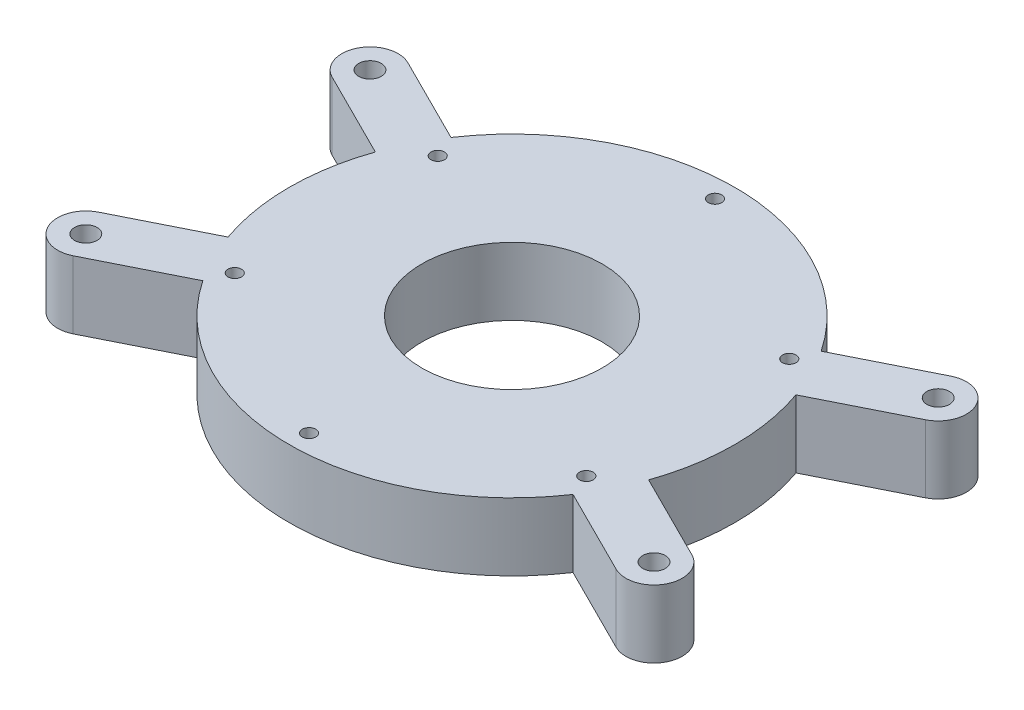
ISO-10303-21;
HEADER;
FILE_DESCRIPTION(('STEP AP214'),'2;1');
FILE_NAME('part.step','',(''),(''),'','','');
FILE_SCHEMA(('AUTOMOTIVE_DESIGN { 1 0 10303 214 1 1 1 1 }'));
ENDSEC;
DATA;
#1=APPLICATION_CONTEXT('core data for automotive mechanical design processes');
#2=APPLICATION_PROTOCOL_DEFINITION('international standard','automotive_design',2000,#1);
#3=PRODUCT_CONTEXT('',#1,'mechanical');
#4=PRODUCT('Part','Part','',(#3));
#5=PRODUCT_RELATED_PRODUCT_CATEGORY('part','',(#4));
#6=PRODUCT_DEFINITION_FORMATION('','',#4);
#7=PRODUCT_DEFINITION_CONTEXT('part definition',#1,'design');
#8=PRODUCT_DEFINITION('design','',#6,#7);
#9=PRODUCT_DEFINITION_SHAPE('','',#8);
#10=(LENGTH_UNIT() NAMED_UNIT(*) SI_UNIT(.MILLI.,.METRE.));
#11=(NAMED_UNIT(*) PLANE_ANGLE_UNIT() SI_UNIT($,.RADIAN.));
#12=(NAMED_UNIT(*) SI_UNIT($,.STERADIAN.) SOLID_ANGLE_UNIT());
#13=UNCERTAINTY_MEASURE_WITH_UNIT(LENGTH_MEASURE(1.E-05),#10,'distance_accuracy_value','');
#14=(GEOMETRIC_REPRESENTATION_CONTEXT(3) GLOBAL_UNCERTAINTY_ASSIGNED_CONTEXT((#13)) GLOBAL_UNIT_ASSIGNED_CONTEXT((#10,
#11,#12)) REPRESENTATION_CONTEXT('',''));
#15=CARTESIAN_POINT('',(0.,0.,0.));
#16=DIRECTION('',(0.,0.,1.));
#17=DIRECTION('',(1.,0.,0.));
#18=AXIS2_PLACEMENT_3D('',#15,#16,#17);
#19=CARTESIAN_POINT('',(0.,15.,0.));
#20=DIRECTION('',(0.,-1.,0.));
#21=DIRECTION('',(0.,0.,-1.));
#22=AXIS2_PLACEMENT_3D('',#19,#20,#21);
#23=CYLINDRICAL_SURFACE('',#22,49.4);
#24=CARTESIAN_POINT('',(0.,0.,0.));
#25=DIRECTION('',(0.,1.,0.));
#26=DIRECTION('',(0.,0.,1.));
#27=AXIS2_PLACEMENT_3D('',#24,#25,#26);
#28=CIRCLE('',#27,49.4);
#29=CARTESIAN_POINT('',(-41.0321866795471,0.,27.5085378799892));
#30=VERTEX_POINT('',#29);
#31=CARTESIAN_POINT('',(41.0321866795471,0.,27.5085378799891));
#32=VERTEX_POINT('',#31);
#33=EDGE_CURVE('E248',#30,#32,#28,.T.);
#34=ORIENTED_EDGE('',*,*,#33,.T.);
#35=DIRECTION('',(0.,-1.,0.));
#36=VECTOR('',#35,1.);
#37=CARTESIAN_POINT('',(41.0321866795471,15.,27.5085378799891));
#38=LINE('',#37,#36);
#39=CARTESIAN_POINT('',(41.0321866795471,15.,27.5085378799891));
#40=VERTEX_POINT('',#39);
#41=EDGE_CURVE('E12',#40,#32,#38,.T.);
#42=ORIENTED_EDGE('',*,*,#41,.F.);
#43=CARTESIAN_POINT('',(0.,15.,0.));
#44=DIRECTION('',(0.,1.,0.));
#45=DIRECTION('',(0.,0.,1.));
#46=AXIS2_PLACEMENT_3D('',#43,#44,#45);
#47=CIRCLE('',#46,49.4);
#48=CARTESIAN_POINT('',(-41.0321866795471,15.,27.5085378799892));
#49=VERTEX_POINT('',#48);
#50=EDGE_CURVE('E178',#49,#40,#47,.T.);
#51=ORIENTED_EDGE('',*,*,#50,.F.);
#52=DIRECTION('',(0.,-1.,0.));
#53=VECTOR('',#52,1.);
#54=CARTESIAN_POINT('',(-41.0321866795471,15.,27.5085378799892));
#55=LINE('',#54,#53);
#56=EDGE_CURVE('E244',#49,#30,#55,.T.);
#57=ORIENTED_EDGE('',*,*,#56,.T.);
#58=EDGE_LOOP('',(#34,#42,#51,#57));
#59=FACE_BOUND('',#58,.T.);
#60=ADVANCED_FACE('F96',(#59),#23,.T.);
#61=CARTESIAN_POINT('',(-2.79556780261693,15.,5.58992850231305));
#62=DIRECTION('',(-0.447290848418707,0.,0.894388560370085));
#63=DIRECTION('',(0.894388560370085,0.,0.447290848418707));
#64=AXIS2_PLACEMENT_3D('',#61,#62,#63);
#65=PLANE('',#64);
#66=DIRECTION('',(-0.894388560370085,0.,-0.447290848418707));
#67=VECTOR('',#66,1.);
#68=CARTESIAN_POINT('',(-2.79556780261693,0.,5.58992850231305));
#69=LINE('',#68,#67);
#70=CARTESIAN_POINT('',(60.1908307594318,0.,37.089928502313));
#71=VERTEX_POINT('',#70);
#72=EDGE_CURVE('E252',#71,#32,#69,.T.);
#73=ORIENTED_EDGE('',*,*,#72,.F.);
#74=DIRECTION('',(0.,-1.,0.));
#75=VECTOR('',#74,1.);
#76=CARTESIAN_POINT('',(60.1908307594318,15.,37.089928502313));
#77=LINE('',#76,#75);
#78=CARTESIAN_POINT('',(60.1908307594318,15.,37.089928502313));
#79=VERTEX_POINT('',#78);
#80=EDGE_CURVE('E106',#79,#71,#77,.T.);
#81=ORIENTED_EDGE('',*,*,#80,.F.);
#82=DIRECTION('',(-0.894388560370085,0.,-0.447290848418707));
#83=VECTOR('',#82,1.);
#84=CARTESIAN_POINT('',(-2.79556780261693,15.,5.58992850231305));
#85=LINE('',#84,#83);
#86=EDGE_CURVE('E330',#79,#40,#85,.T.);
#87=ORIENTED_EDGE('',*,*,#86,.T.);
#88=ORIENTED_EDGE('',*,*,#41,.T.);
#89=EDGE_LOOP('',(#73,#81,#87,#88));
#90=FACE_BOUND('',#89,.T.);
#91=ADVANCED_FACE('F411',(#90),#65,.T.);
#92=CARTESIAN_POINT('',(62.9863985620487,15.,31.5));
#93=DIRECTION('',(0.,-1.,0.));
#94=DIRECTION('',(0.,0.,-1.));
#95=AXIS2_PLACEMENT_3D('',#92,#93,#94);
#96=CYLINDRICAL_SURFACE('',#95,6.25);
#97=CARTESIAN_POINT('',(62.9863985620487,0.,31.5));
#98=DIRECTION('',(0.,1.,0.));
#99=DIRECTION('',(0.,0.,1.));
#100=AXIS2_PLACEMENT_3D('',#97,#98,#99);
#101=CIRCLE('',#100,6.25);
#102=CARTESIAN_POINT('',(65.7819663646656,0.,25.9100714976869));
#103=VERTEX_POINT('',#102);
#104=EDGE_CURVE('E257',#103,#71,#101,.F.);
#105=ORIENTED_EDGE('',*,*,#104,.F.);
#106=DIRECTION('',(0.,-1.,0.));
#107=VECTOR('',#106,1.);
#108=CARTESIAN_POINT('',(65.7819663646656,15.,25.9100714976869));
#109=LINE('',#108,#107);
#110=CARTESIAN_POINT('',(65.7819663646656,15.,25.9100714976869));
#111=VERTEX_POINT('',#110);
#112=EDGE_CURVE('E304',#111,#103,#109,.T.);
#113=ORIENTED_EDGE('',*,*,#112,.F.);
#114=CARTESIAN_POINT('',(62.9863985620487,15.,31.5));
#115=DIRECTION('',(0.,1.,0.));
#116=DIRECTION('',(0.,0.,1.));
#117=AXIS2_PLACEMENT_3D('',#114,#115,#116);
#118=CIRCLE('',#117,6.25);
#119=EDGE_CURVE('E334',#111,#79,#118,.F.);
#120=ORIENTED_EDGE('',*,*,#119,.T.);
#121=ORIENTED_EDGE('',*,*,#80,.T.);
#122=EDGE_LOOP('',(#105,#113,#120,#121));
#123=FACE_BOUND('',#122,.T.);
#124=ADVANCED_FACE('F416',(#123),#96,.T.);
#125=CARTESIAN_POINT('',(2.7955678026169,15.,-5.58992850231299));
#126=DIRECTION('',(-0.447290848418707,0.,0.894388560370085));
#127=DIRECTION('',(0.894388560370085,0.,0.447290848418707));
#128=AXIS2_PLACEMENT_3D('',#125,#126,#127);
#129=PLANE('',#128);
#130=DIRECTION('',(-0.894388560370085,0.,-0.447290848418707));
#131=VECTOR('',#130,1.);
#132=CARTESIAN_POINT('',(2.7955678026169,0.,-5.58992850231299));
#133=LINE('',#132,#131);
#134=CARTESIAN_POINT('',(46.623322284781,0.,16.3286808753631));
#135=VERTEX_POINT('',#134);
#136=EDGE_CURVE('E260',#103,#135,#133,.T.);
#137=ORIENTED_EDGE('',*,*,#136,.T.);
#138=DIRECTION('',(0.,-1.,0.));
#139=VECTOR('',#138,1.);
#140=CARTESIAN_POINT('',(46.623322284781,15.,16.3286808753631));
#141=LINE('',#140,#139);
#142=CARTESIAN_POINT('',(46.623322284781,15.,16.3286808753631));
#143=VERTEX_POINT('',#142);
#144=EDGE_CURVE('E301',#143,#135,#141,.T.);
#145=ORIENTED_EDGE('',*,*,#144,.F.);
#146=DIRECTION('',(-0.894388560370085,0.,-0.447290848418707));
#147=VECTOR('',#146,1.);
#148=CARTESIAN_POINT('',(2.7955678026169,15.,-5.58992850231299));
#149=LINE('',#148,#147);
#150=EDGE_CURVE('E337',#111,#143,#149,.T.);
#151=ORIENTED_EDGE('',*,*,#150,.F.);
#152=ORIENTED_EDGE('',*,*,#112,.T.);
#153=EDGE_LOOP('',(#137,#145,#151,#152));
#154=FACE_BOUND('',#153,.T.);
#155=ADVANCED_FACE('F422',(#154),#129,.F.);
#156=CARTESIAN_POINT('',(46.6233222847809,0.,-16.3286808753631));
#157=VERTEX_POINT('',#156);
#158=EDGE_CURVE('E254',#135,#157,#28,.T.);
#159=ORIENTED_EDGE('',*,*,#158,.T.);
#160=DIRECTION('',(0.,-1.,0.));
#161=VECTOR('',#160,1.);
#162=CARTESIAN_POINT('',(46.6233222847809,15.,-16.3286808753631));
#163=LINE('',#162,#161);
#164=CARTESIAN_POINT('',(46.6233222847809,15.,-16.3286808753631));
#165=VERTEX_POINT('',#164);
#166=EDGE_CURVE('E299',#165,#157,#163,.T.);
#167=ORIENTED_EDGE('',*,*,#166,.F.);
#168=EDGE_CURVE('E331',#143,#165,#47,.T.);
#169=ORIENTED_EDGE('',*,*,#168,.F.);
#170=ORIENTED_EDGE('',*,*,#144,.T.);
#171=EDGE_LOOP('',(#159,#167,#169,#170));
#172=FACE_BOUND('',#171,.T.);
#173=ADVANCED_FACE('F358',(#172),#23,.T.);
#174=CARTESIAN_POINT('',(2.7955678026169,15.,5.58992850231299));
#175=DIRECTION('',(0.447290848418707,0.,0.894388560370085));
#176=DIRECTION('',(0.894388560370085,0.,-0.447290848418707));
#177=AXIS2_PLACEMENT_3D('',#174,#175,#176);
#178=PLANE('',#177);
#179=DIRECTION('',(-0.894388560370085,0.,0.447290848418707));
#180=VECTOR('',#179,1.);
#181=CARTESIAN_POINT('',(2.7955678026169,0.,5.58992850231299));
#182=LINE('',#181,#180);
#183=CARTESIAN_POINT('',(65.7819663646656,0.,-25.910071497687));
#184=VERTEX_POINT('',#183);
#185=EDGE_CURVE('E262',#184,#157,#182,.T.);
#186=ORIENTED_EDGE('',*,*,#185,.F.);
#187=DIRECTION('',(0.,-1.,0.));
#188=VECTOR('',#187,1.);
#189=CARTESIAN_POINT('',(65.7819663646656,15.,-25.910071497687));
#190=LINE('',#189,#188);
#191=CARTESIAN_POINT('',(65.7819663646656,15.,-25.910071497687));
#192=VERTEX_POINT('',#191);
#193=EDGE_CURVE('E297',#192,#184,#190,.T.);
#194=ORIENTED_EDGE('',*,*,#193,.F.);
#195=DIRECTION('',(-0.894388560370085,0.,0.447290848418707));
#196=VECTOR('',#195,1.);
#197=CARTESIAN_POINT('',(2.7955678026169,15.,5.58992850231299));
#198=LINE('',#197,#196);
#199=EDGE_CURVE('E339',#192,#165,#198,.T.);
#200=ORIENTED_EDGE('',*,*,#199,.T.);
#201=ORIENTED_EDGE('',*,*,#166,.T.);
#202=EDGE_LOOP('',(#186,#194,#200,#201));
#203=FACE_BOUND('',#202,.T.);
#204=ADVANCED_FACE('F362',(#203),#178,.T.);
#205=CARTESIAN_POINT('',(62.9863985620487,15.,-31.5));
#206=DIRECTION('',(0.,-1.,0.));
#207=DIRECTION('',(0.,0.,-1.));
#208=AXIS2_PLACEMENT_3D('',#205,#206,#207);
#209=CYLINDRICAL_SURFACE('',#208,6.25);
#210=CARTESIAN_POINT('',(62.9863985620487,0.,-31.5));
#211=DIRECTION('',(0.,1.,0.));
#212=DIRECTION('',(0.,0.,1.));
#213=AXIS2_PLACEMENT_3D('',#210,#211,#212);
#214=CIRCLE('',#213,6.25);
#215=CARTESIAN_POINT('',(60.1908307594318,0.,-37.089928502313));
#216=VERTEX_POINT('',#215);
#217=EDGE_CURVE('E265',#184,#216,#214,.T.);
#218=ORIENTED_EDGE('',*,*,#217,.T.);
#219=DIRECTION('',(0.,-1.,0.));
#220=VECTOR('',#219,1.);
#221=CARTESIAN_POINT('',(60.1908307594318,15.,-37.089928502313));
#222=LINE('',#221,#220);
#223=CARTESIAN_POINT('',(60.1908307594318,15.,-37.089928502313));
#224=VERTEX_POINT('',#223);
#225=EDGE_CURVE('E294',#224,#216,#222,.T.);
#226=ORIENTED_EDGE('',*,*,#225,.F.);
#227=CARTESIAN_POINT('',(62.9863985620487,15.,-31.5));
#228=DIRECTION('',(0.,1.,0.));
#229=DIRECTION('',(0.,0.,1.));
#230=AXIS2_PLACEMENT_3D('',#227,#228,#229);
#231=CIRCLE('',#230,6.25);
#232=EDGE_CURVE('E342',#192,#224,#231,.T.);
#233=ORIENTED_EDGE('',*,*,#232,.F.);
#234=ORIENTED_EDGE('',*,*,#193,.T.);
#235=EDGE_LOOP('',(#218,#226,#233,#234));
#236=FACE_BOUND('',#235,.T.);
#237=ADVANCED_FACE('F367',(#236),#209,.T.);
#238=CARTESIAN_POINT('',(-2.79556780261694,15.,-5.58992850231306));
#239=DIRECTION('',(0.447290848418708,0.,0.894388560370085));
#240=DIRECTION('',(0.894388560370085,0.,-0.447290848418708));
#241=AXIS2_PLACEMENT_3D('',#238,#239,#240);
#242=PLANE('',#241);
#243=DIRECTION('',(-0.894388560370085,0.,0.447290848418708));
#244=VECTOR('',#243,1.);
#245=CARTESIAN_POINT('',(-2.79556780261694,0.,-5.58992850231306));
#246=LINE('',#245,#244);
#247=CARTESIAN_POINT('',(41.0321866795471,0.,-27.5085378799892));
#248=VERTEX_POINT('',#247);
#249=EDGE_CURVE('E267',#216,#248,#246,.T.);
#250=ORIENTED_EDGE('',*,*,#249,.T.);
#251=DIRECTION('',(0.,-1.,0.));
#252=VECTOR('',#251,1.);
#253=CARTESIAN_POINT('',(41.0321866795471,15.,-27.5085378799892));
#254=LINE('',#253,#252);
#255=CARTESIAN_POINT('',(41.0321866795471,15.,-27.5085378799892));
#256=VERTEX_POINT('',#255);
#257=EDGE_CURVE('E291',#256,#248,#254,.T.);
#258=ORIENTED_EDGE('',*,*,#257,.F.);
#259=DIRECTION('',(-0.894388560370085,0.,0.447290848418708));
#260=VECTOR('',#259,1.);
#261=CARTESIAN_POINT('',(-2.79556780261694,15.,-5.58992850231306));
#262=LINE('',#261,#260);
#263=EDGE_CURVE('E344',#224,#256,#262,.T.);
#264=ORIENTED_EDGE('',*,*,#263,.F.);
#265=ORIENTED_EDGE('',*,*,#225,.T.);
#266=EDGE_LOOP('',(#250,#258,#264,#265));
#267=FACE_BOUND('',#266,.T.);
#268=ADVANCED_FACE('F371',(#267),#242,.F.);
#269=CARTESIAN_POINT('',(-41.0321866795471,0.,-27.5085378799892));
#270=VERTEX_POINT('',#269);
#271=EDGE_CURVE('E269',#248,#270,#28,.T.);
#272=ORIENTED_EDGE('',*,*,#271,.T.);
#273=DIRECTION('',(0.,-1.,0.));
#274=VECTOR('',#273,1.);
#275=CARTESIAN_POINT('',(-41.0321866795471,15.,-27.5085378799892));
#276=LINE('',#275,#274);
#277=CARTESIAN_POINT('',(-41.0321866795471,15.,-27.5085378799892));
#278=VERTEX_POINT('',#277);
#279=EDGE_CURVE('E289',#278,#270,#276,.T.);
#280=ORIENTED_EDGE('',*,*,#279,.F.);
#281=EDGE_CURVE('E239',#256,#278,#47,.T.);
#282=ORIENTED_EDGE('',*,*,#281,.F.);
#283=ORIENTED_EDGE('',*,*,#257,.T.);
#284=EDGE_LOOP('',(#272,#280,#282,#283));
#285=FACE_BOUND('',#284,.T.);
#286=ADVANCED_FACE('F376',(#285),#23,.T.);
#287=CARTESIAN_POINT('',(2.79556780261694,15.,-5.58992850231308));
#288=DIRECTION('',(0.447290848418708,0.,-0.894388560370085));
#289=DIRECTION('',(-0.894388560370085,0.,-0.447290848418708));
#290=AXIS2_PLACEMENT_3D('',#287,#288,#289);
#291=PLANE('',#290);
#292=DIRECTION('',(0.894388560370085,0.,0.447290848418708));
#293=VECTOR('',#292,1.);
#294=CARTESIAN_POINT('',(2.79556780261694,0.,-5.58992850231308));
#295=LINE('',#294,#293);
#296=CARTESIAN_POINT('',(-60.1908307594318,0.,-37.089928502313));
#297=VERTEX_POINT('',#296);
#298=EDGE_CURVE('E270',#297,#270,#295,.T.);
#299=ORIENTED_EDGE('',*,*,#298,.F.);
#300=DIRECTION('',(0.,-1.,0.));
#301=VECTOR('',#300,1.);
#302=CARTESIAN_POINT('',(-60.1908307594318,15.,-37.089928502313));
#303=LINE('',#302,#301);
#304=CARTESIAN_POINT('',(-60.1908307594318,15.,-37.089928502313));
#305=VERTEX_POINT('',#304);
#306=EDGE_CURVE('E287',#305,#297,#303,.T.);
#307=ORIENTED_EDGE('',*,*,#306,.F.);
#308=DIRECTION('',(0.894388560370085,0.,0.447290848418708));
#309=VECTOR('',#308,1.);
#310=CARTESIAN_POINT('',(2.79556780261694,15.,-5.58992850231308));
#311=LINE('',#310,#309);
#312=EDGE_CURVE('E345',#305,#278,#311,.T.);
#313=ORIENTED_EDGE('',*,*,#312,.T.);
#314=ORIENTED_EDGE('',*,*,#279,.T.);
#315=EDGE_LOOP('',(#299,#307,#313,#314));
#316=FACE_BOUND('',#315,.T.);
#317=ADVANCED_FACE('F377',(#316),#291,.T.);
#318=CARTESIAN_POINT('',(-2.79556780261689,15.,5.58992850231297));
#319=DIRECTION('',(0.447290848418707,0.,-0.894388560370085));
#320=DIRECTION('',(-0.894388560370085,0.,-0.447290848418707));
#321=AXIS2_PLACEMENT_3D('',#318,#319,#320);
#322=PLANE('',#321);
#323=DIRECTION('',(0.894388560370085,0.,0.447290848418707));
#324=VECTOR('',#323,1.);
#325=CARTESIAN_POINT('',(-2.79556780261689,0.,5.58992850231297));
#326=LINE('',#325,#324);
#327=CARTESIAN_POINT('',(-65.7819663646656,0.,-25.910071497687));
#328=VERTEX_POINT('',#327);
#329=CARTESIAN_POINT('',(-46.6233222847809,0.,-16.3286808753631));
#330=VERTEX_POINT('',#329);
#331=EDGE_CURVE('E273',#328,#330,#326,.T.);
#332=ORIENTED_EDGE('',*,*,#331,.T.);
#333=DIRECTION('',(0.,-1.,0.));
#334=VECTOR('',#333,1.);
#335=CARTESIAN_POINT('',(-46.6233222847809,15.,-16.3286808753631));
#336=LINE('',#335,#334);
#337=CARTESIAN_POINT('',(-46.6233222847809,15.,-16.3286808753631));
#338=VERTEX_POINT('',#337);
#339=EDGE_CURVE('E282',#338,#330,#336,.T.);
#340=ORIENTED_EDGE('',*,*,#339,.F.);
#341=DIRECTION('',(0.894388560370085,0.,0.447290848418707));
#342=VECTOR('',#341,1.);
#343=CARTESIAN_POINT('',(-2.79556780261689,15.,5.58992850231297));
#344=LINE('',#343,#342);
#345=CARTESIAN_POINT('',(-65.7819663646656,15.,-25.910071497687));
#346=VERTEX_POINT('',#345);
#347=EDGE_CURVE('E237',#346,#338,#344,.T.);
#348=ORIENTED_EDGE('',*,*,#347,.F.);
#349=DIRECTION('',(0.,-1.,0.));
#350=VECTOR('',#349,1.);
#351=CARTESIAN_POINT('',(-65.7819663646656,15.,-25.910071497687));
#352=LINE('',#351,#350);
#353=EDGE_CURVE('E285',#346,#328,#352,.T.);
#354=ORIENTED_EDGE('',*,*,#353,.T.);
#355=EDGE_LOOP('',(#332,#340,#348,#354));
#356=FACE_BOUND('',#355,.T.);
#357=ADVANCED_FACE('F424',(#356),#322,.F.);
#358=CARTESIAN_POINT('',(-46.6233222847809,0.,16.3286808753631));
#359=VERTEX_POINT('',#358);
#360=EDGE_CURVE('E253',#330,#359,#28,.T.);
#361=ORIENTED_EDGE('',*,*,#360,.T.);
#362=DIRECTION('',(0.,-1.,0.));
#363=VECTOR('',#362,1.);
#364=CARTESIAN_POINT('',(-46.6233222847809,15.,16.3286808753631));
#365=LINE('',#364,#363);
#366=CARTESIAN_POINT('',(-46.6233222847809,15.,16.3286808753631));
#367=VERTEX_POINT('',#366);
#368=EDGE_CURVE('E226',#367,#359,#365,.T.);
#369=ORIENTED_EDGE('',*,*,#368,.F.);
#370=EDGE_CURVE('E234',#338,#367,#47,.T.);
#371=ORIENTED_EDGE('',*,*,#370,.F.);
#372=ORIENTED_EDGE('',*,*,#339,.T.);
#373=EDGE_LOOP('',(#361,#369,#371,#372));
#374=FACE_BOUND('',#373,.T.);
#375=ADVANCED_FACE('F383',(#374),#23,.T.);
#376=CARTESIAN_POINT('',(-2.79556780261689,15.,-5.58992850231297));
#377=DIRECTION('',(-0.447290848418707,0.,-0.894388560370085));
#378=DIRECTION('',(-0.894388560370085,0.,0.447290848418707));
#379=AXIS2_PLACEMENT_3D('',#376,#377,#378);
#380=PLANE('',#379);
#381=DIRECTION('',(0.894388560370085,0.,-0.447290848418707));
#382=VECTOR('',#381,1.);
#383=CARTESIAN_POINT('',(-2.79556780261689,0.,-5.58992850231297));
#384=LINE('',#383,#382);
#385=CARTESIAN_POINT('',(-65.7819663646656,0.,25.910071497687));
#386=VERTEX_POINT('',#385);
#387=EDGE_CURVE('E225',#386,#359,#384,.T.);
#388=ORIENTED_EDGE('',*,*,#387,.F.);
#389=DIRECTION('',(0.,-1.,0.));
#390=VECTOR('',#389,1.);
#391=CARTESIAN_POINT('',(-65.7819663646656,15.,25.910071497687));
#392=LINE('',#391,#390);
#393=CARTESIAN_POINT('',(-65.7819663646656,15.,25.910071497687));
#394=VERTEX_POINT('',#393);
#395=EDGE_CURVE('E219',#394,#386,#392,.T.);
#396=ORIENTED_EDGE('',*,*,#395,.F.);
#397=DIRECTION('',(0.894388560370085,0.,-0.447290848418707));
#398=VECTOR('',#397,1.);
#399=CARTESIAN_POINT('',(-2.79556780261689,15.,-5.58992850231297));
#400=LINE('',#399,#398);
#401=EDGE_CURVE('E223',#394,#367,#400,.T.);
#402=ORIENTED_EDGE('',*,*,#401,.T.);
#403=ORIENTED_EDGE('',*,*,#368,.T.);
#404=EDGE_LOOP('',(#388,#396,#402,#403));
#405=FACE_BOUND('',#404,.T.);
#406=ADVANCED_FACE('F221',(#405),#380,.T.);
#407=CARTESIAN_POINT('',(-62.9863985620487,15.,31.5));
#408=DIRECTION('',(0.,-1.,0.));
#409=DIRECTION('',(0.,0.,-1.));
#410=AXIS2_PLACEMENT_3D('',#407,#408,#409);
#411=CYLINDRICAL_SURFACE('',#410,6.25000000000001);
#412=CARTESIAN_POINT('',(-62.9863985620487,0.,31.5));
#413=DIRECTION('',(0.,1.,0.));
#414=DIRECTION('',(0.,0.,1.));
#415=AXIS2_PLACEMENT_3D('',#412,#413,#414);
#416=CIRCLE('',#415,6.25000000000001);
#417=CARTESIAN_POINT('',(-60.1908307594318,0.,37.089928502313));
#418=VERTEX_POINT('',#417);
#419=EDGE_CURVE('E166',#386,#418,#416,.T.);
#420=ORIENTED_EDGE('',*,*,#419,.T.);
#421=DIRECTION('',(0.,-1.,0.));
#422=VECTOR('',#421,1.);
#423=CARTESIAN_POINT('',(-60.1908307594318,15.,37.089928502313));
#424=LINE('',#423,#422);
#425=CARTESIAN_POINT('',(-60.1908307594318,15.,37.089928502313));
#426=VERTEX_POINT('',#425);
#427=EDGE_CURVE('E227',#426,#418,#424,.T.);
#428=ORIENTED_EDGE('',*,*,#427,.F.);
#429=CARTESIAN_POINT('',(-62.9863985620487,15.,31.5));
#430=DIRECTION('',(0.,1.,0.));
#431=DIRECTION('',(0.,0.,1.));
#432=AXIS2_PLACEMENT_3D('',#429,#430,#431);
#433=CIRCLE('',#432,6.25000000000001);
#434=EDGE_CURVE('E229',#394,#426,#433,.T.);
#435=ORIENTED_EDGE('',*,*,#434,.F.);
#436=ORIENTED_EDGE('',*,*,#395,.T.);
#437=EDGE_LOOP('',(#420,#428,#435,#436));
#438=FACE_BOUND('',#437,.T.);
#439=ADVANCED_FACE('F230',(#438),#411,.T.);
#440=CARTESIAN_POINT('',(0.,15.,0.));
#441=DIRECTION('',(0.,-1.,0.));
#442=DIRECTION('',(0.,0.,-1.));
#443=AXIS2_PLACEMENT_3D('',#440,#441,#442);
#444=CYLINDRICAL_SURFACE('',#443,20.);
#445=CARTESIAN_POINT('',(0.,15.,0.));
#446=DIRECTION('',(0.,1.,0.));
#447=DIRECTION('',(0.,0.,1.));
#448=AXIS2_PLACEMENT_3D('',#445,#446,#447);
#449=CIRCLE('',#448,20.);
#450=CARTESIAN_POINT('',(0.,15.,20.));
#451=VERTEX_POINT('',#450);
#452=EDGE_CURVE('E278',#451,#451,#449,.T.);
#453=ORIENTED_EDGE('',*,*,#452,.T.);
#454=EDGE_LOOP('',(#453));
#455=FACE_BOUND('',#454,.T.);
#456=CARTESIAN_POINT('',(0.,0.,0.));
#457=DIRECTION('',(0.,1.,0.));
#458=DIRECTION('',(0.,0.,1.));
#459=AXIS2_PLACEMENT_3D('',#456,#457,#458);
#460=CIRCLE('',#459,20.);
#461=CARTESIAN_POINT('',(0.,0.,20.));
#462=VERTEX_POINT('',#461);
#463=EDGE_CURVE('E245',#462,#462,#460,.T.);
#464=ORIENTED_EDGE('',*,*,#463,.F.);
#465=EDGE_LOOP('',(#464));
#466=FACE_BOUND('',#465,.T.);
#467=ADVANCED_FACE('F389',(#455,#466),#444,.F.);
#468=CARTESIAN_POINT('',(2.79556780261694,15.,5.58992850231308));
#469=DIRECTION('',(-0.447290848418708,0.,-0.894388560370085));
#470=DIRECTION('',(-0.894388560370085,0.,0.447290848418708));
#471=AXIS2_PLACEMENT_3D('',#468,#469,#470);
#472=PLANE('',#471);
#473=DIRECTION('',(0.894388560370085,0.,-0.447290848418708));
#474=VECTOR('',#473,1.);
#475=CARTESIAN_POINT('',(2.79556780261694,0.,5.58992850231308));
#476=LINE('',#475,#474);
#477=EDGE_CURVE('E172',#418,#30,#476,.T.);
#478=ORIENTED_EDGE('',*,*,#477,.T.);
#479=ORIENTED_EDGE('',*,*,#56,.F.);
#480=DIRECTION('',(0.894388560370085,0.,-0.447290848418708));
#481=VECTOR('',#480,1.);
#482=CARTESIAN_POINT('',(2.79556780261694,15.,5.58992850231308));
#483=LINE('',#482,#481);
#484=EDGE_CURVE('E115',#426,#49,#483,.T.);
#485=ORIENTED_EDGE('',*,*,#484,.F.);
#486=ORIENTED_EDGE('',*,*,#427,.T.);
#487=EDGE_LOOP('',(#478,#479,#485,#486));
#488=FACE_BOUND('',#487,.T.);
#489=ADVANCED_FACE('F387',(#488),#472,.F.);
#490=CARTESIAN_POINT('',(0.,15.,0.));
#491=DIRECTION('',(0.,1.,0.));
#492=DIRECTION('',(0.,0.,1.));
#493=AXIS2_PLACEMENT_3D('',#490,#491,#492);
#494=PLANE('',#493);
#495=CARTESIAN_POINT('',(38.9711431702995,15.,-22.5000000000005));
#496=DIRECTION('',(0.,-1.,0.));
#497=DIRECTION('',(0.866025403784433,0.,-0.50000000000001));
#498=AXIS2_PLACEMENT_3D('',#495,#496,#497);
#499=CIRCLE('',#498,1.5);
#500=CARTESIAN_POINT('',(40.2701812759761,15.,-23.2500000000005));
#501=VERTEX_POINT('',#500);
#502=EDGE_CURVE('E907',#501,#501,#499,.T.);
#503=ORIENTED_EDGE('',*,*,#502,.T.);
#504=EDGE_LOOP('',(#503));
#505=FACE_BOUND('',#504,.T.);
#506=CARTESIAN_POINT('',(38.9711431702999,15.,22.4999999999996));
#507=DIRECTION('',(0.,-1.,0.));
#508=DIRECTION('',(0.866025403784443,0.,0.499999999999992));
#509=AXIS2_PLACEMENT_3D('',#506,#507,#508);
#510=CIRCLE('',#509,1.5);
#511=CARTESIAN_POINT('',(40.2701812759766,15.,23.2499999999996));
#512=VERTEX_POINT('',#511);
#513=EDGE_CURVE('E1023',#512,#512,#510,.T.);
#514=ORIENTED_EDGE('',*,*,#513,.T.);
#515=EDGE_LOOP('',(#514));
#516=FACE_BOUND('',#515,.T.);
#517=CARTESIAN_POINT('',(0.,15.,45.));
#518=DIRECTION('',(0.,-1.,0.));
#519=DIRECTION('',(0.,0.,1.));
#520=AXIS2_PLACEMENT_3D('',#517,#518,#519);
#521=CIRCLE('',#520,1.5);
#522=CARTESIAN_POINT('',(0.,15.,46.5));
#523=VERTEX_POINT('',#522);
#524=EDGE_CURVE('E1015',#523,#523,#521,.T.);
#525=ORIENTED_EDGE('',*,*,#524,.T.);
#526=EDGE_LOOP('',(#525));
#527=FACE_BOUND('',#526,.T.);
#528=CARTESIAN_POINT('',(-38.9711431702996,15.,22.5000000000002));
#529=DIRECTION('',(0.,-1.,0.));
#530=DIRECTION('',(-0.866025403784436,0.,0.500000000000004));
#531=AXIS2_PLACEMENT_3D('',#528,#529,#530);
#532=CIRCLE('',#531,1.5);
#533=CARTESIAN_POINT('',(-40.2701812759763,15.,23.2500000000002));
#534=VERTEX_POINT('',#533);
#535=EDGE_CURVE('E923',#534,#534,#532,.T.);
#536=ORIENTED_EDGE('',*,*,#535,.T.);
#537=EDGE_LOOP('',(#536));
#538=FACE_BOUND('',#537,.T.);
#539=CARTESIAN_POINT('',(-38.9711431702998,15.,-22.4999999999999));
#540=DIRECTION('',(0.,-1.,0.));
#541=DIRECTION('',(-0.86602540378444,0.,-0.499999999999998));
#542=AXIS2_PLACEMENT_3D('',#539,#540,#541);
#543=CIRCLE('',#542,1.5);
#544=CARTESIAN_POINT('',(-40.2701812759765,15.,-23.2499999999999));
#545=VERTEX_POINT('',#544);
#546=EDGE_CURVE('E916',#545,#545,#543,.T.);
#547=ORIENTED_EDGE('',*,*,#546,.T.);
#548=EDGE_LOOP('',(#547));
#549=FACE_BOUND('',#548,.T.);
#550=CARTESIAN_POINT('',(0.,15.,-45.));
#551=DIRECTION('',(0.,-1.,0.));
#552=DIRECTION('',(0.,0.,-1.));
#553=AXIS2_PLACEMENT_3D('',#550,#551,#552);
#554=CIRCLE('',#553,1.5);
#555=CARTESIAN_POINT('',(0.,15.,-46.5));
#556=VERTEX_POINT('',#555);
#557=EDGE_CURVE('E924',#556,#556,#554,.T.);
#558=ORIENTED_EDGE('',*,*,#557,.T.);
#559=EDGE_LOOP('',(#558));
#560=FACE_BOUND('',#559,.T.);
#561=CARTESIAN_POINT('',(62.9863985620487,15.,-31.5));
#562=DIRECTION('',(0.,-1.,0.));
#563=DIRECTION('',(0.,0.,1.));
#564=AXIS2_PLACEMENT_3D('',#561,#562,#563);
#565=CIRCLE('',#564,2.50000000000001);
#566=CARTESIAN_POINT('',(62.9863985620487,15.,-29.));
#567=VERTEX_POINT('',#566);
#568=EDGE_CURVE('E951',#567,#567,#565,.T.);
#569=ORIENTED_EDGE('',*,*,#568,.T.);
#570=EDGE_LOOP('',(#569));
#571=FACE_BOUND('',#570,.T.);
#572=CARTESIAN_POINT('',(62.9863985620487,15.,31.5));
#573=DIRECTION('',(0.,1.,0.));
#574=DIRECTION('',(0.,0.,-1.));
#575=AXIS2_PLACEMENT_3D('',#572,#573,#574);
#576=CIRCLE('',#575,2.50000000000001);
#577=CARTESIAN_POINT('',(62.9863985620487,15.,29.));
#578=VERTEX_POINT('',#577);
#579=EDGE_CURVE('E957',#578,#578,#576,.T.);
#580=ORIENTED_EDGE('',*,*,#579,.F.);
#581=EDGE_LOOP('',(#580));
#582=FACE_BOUND('',#581,.T.);
#583=CARTESIAN_POINT('',(-62.9863985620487,15.,31.5));
#584=DIRECTION('',(0.,-1.,0.));
#585=DIRECTION('',(0.,0.,-1.));
#586=AXIS2_PLACEMENT_3D('',#583,#584,#585);
#587=CIRCLE('',#586,2.50000000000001);
#588=CARTESIAN_POINT('',(-62.9863985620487,15.,29.));
#589=VERTEX_POINT('',#588);
#590=EDGE_CURVE('E325',#589,#589,#587,.T.);
#591=ORIENTED_EDGE('',*,*,#590,.T.);
#592=EDGE_LOOP('',(#591));
#593=FACE_BOUND('',#592,.T.);
#594=CARTESIAN_POINT('',(-62.9863985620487,15.,-31.5));
#595=DIRECTION('',(0.,1.,0.));
#596=DIRECTION('',(0.,0.,1.));
#597=AXIS2_PLACEMENT_3D('',#594,#595,#596);
#598=CIRCLE('',#597,2.50000000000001);
#599=CARTESIAN_POINT('',(-62.9863985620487,15.,-29.));
#600=VERTEX_POINT('',#599);
#601=EDGE_CURVE('E317',#600,#600,#598,.T.);
#602=ORIENTED_EDGE('',*,*,#601,.F.);
#603=EDGE_LOOP('',(#602));
#604=FACE_BOUND('',#603,.T.);
#605=ORIENTED_EDGE('',*,*,#452,.F.);
#606=EDGE_LOOP('',(#605));
#607=FACE_BOUND('',#606,.T.);
#608=ORIENTED_EDGE('',*,*,#50,.T.);
#609=ORIENTED_EDGE('',*,*,#86,.F.);
#610=ORIENTED_EDGE('',*,*,#119,.F.);
#611=ORIENTED_EDGE('',*,*,#150,.T.);
#612=ORIENTED_EDGE('',*,*,#168,.T.);
#613=ORIENTED_EDGE('',*,*,#199,.F.);
#614=ORIENTED_EDGE('',*,*,#232,.T.);
#615=ORIENTED_EDGE('',*,*,#263,.T.);
#616=ORIENTED_EDGE('',*,*,#281,.T.);
#617=ORIENTED_EDGE('',*,*,#312,.F.);
#618=CARTESIAN_POINT('',(-62.9863985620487,15.,-31.5));
#619=DIRECTION('',(0.,-1.,0.));
#620=DIRECTION('',(0.,0.,-1.));
#621=AXIS2_PLACEMENT_3D('',#618,#619,#620);
#622=CIRCLE('',#621,6.25000000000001);
#623=EDGE_CURVE('E249',#346,#305,#622,.T.);
#624=ORIENTED_EDGE('',*,*,#623,.F.);
#625=ORIENTED_EDGE('',*,*,#347,.T.);
#626=ORIENTED_EDGE('',*,*,#370,.T.);
#627=ORIENTED_EDGE('',*,*,#401,.F.);
#628=ORIENTED_EDGE('',*,*,#434,.T.);
#629=ORIENTED_EDGE('',*,*,#484,.T.);
#630=EDGE_LOOP('',(#608,#609,#610,#611,#612,#613,#614,#615,#616,#617,#624,#625,#626,#627,#628,#629));
#631=FACE_BOUND('',#630,.T.);
#632=ADVANCED_FACE('F232',(#505,#516,#527,#538,#549,#560,#571,#582,#593,#604,#607,#631),#494,.T.);
#633=CARTESIAN_POINT('',(0.,0.,0.));
#634=DIRECTION('',(0.,1.,0.));
#635=DIRECTION('',(0.,0.,1.));
#636=AXIS2_PLACEMENT_3D('',#633,#634,#635);
#637=PLANE('',#636);
#638=CARTESIAN_POINT('',(38.9711431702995,0.,-22.5000000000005));
#639=DIRECTION('',(0.,-1.,0.));
#640=DIRECTION('',(0.866025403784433,0.,-0.50000000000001));
#641=AXIS2_PLACEMENT_3D('',#638,#639,#640);
#642=CIRCLE('',#641,1.5);
#643=CARTESIAN_POINT('',(40.2701812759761,0.,-23.2500000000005));
#644=VERTEX_POINT('',#643);
#645=EDGE_CURVE('E910',#644,#644,#642,.T.);
#646=ORIENTED_EDGE('',*,*,#645,.F.);
#647=EDGE_LOOP('',(#646));
#648=FACE_BOUND('',#647,.T.);
#649=CARTESIAN_POINT('',(38.9711431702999,0.,22.4999999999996));
#650=DIRECTION('',(0.,-1.,0.));
#651=DIRECTION('',(0.866025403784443,0.,0.499999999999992));
#652=AXIS2_PLACEMENT_3D('',#649,#650,#651);
#653=CIRCLE('',#652,1.5);
#654=CARTESIAN_POINT('',(40.2701812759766,0.,23.2499999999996));
#655=VERTEX_POINT('',#654);
#656=EDGE_CURVE('E912',#655,#655,#653,.T.);
#657=ORIENTED_EDGE('',*,*,#656,.F.);
#658=EDGE_LOOP('',(#657));
#659=FACE_BOUND('',#658,.T.);
#660=CARTESIAN_POINT('',(0.,0.,45.));
#661=DIRECTION('',(0.,-1.,0.));
#662=DIRECTION('',(0.,0.,1.));
#663=AXIS2_PLACEMENT_3D('',#660,#661,#662);
#664=CIRCLE('',#663,1.5);
#665=CARTESIAN_POINT('',(0.,0.,46.5));
#666=VERTEX_POINT('',#665);
#667=EDGE_CURVE('E1020',#666,#666,#664,.T.);
#668=ORIENTED_EDGE('',*,*,#667,.F.);
#669=EDGE_LOOP('',(#668));
#670=FACE_BOUND('',#669,.T.);
#671=CARTESIAN_POINT('',(-38.9711431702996,0.,22.5000000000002));
#672=DIRECTION('',(0.,-1.,0.));
#673=DIRECTION('',(-0.866025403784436,0.,0.500000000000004));
#674=AXIS2_PLACEMENT_3D('',#671,#672,#673);
#675=CIRCLE('',#674,1.5);
#676=CARTESIAN_POINT('',(-40.2701812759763,0.,23.2500000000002));
#677=VERTEX_POINT('',#676);
#678=EDGE_CURVE('E1010',#677,#677,#675,.T.);
#679=ORIENTED_EDGE('',*,*,#678,.F.);
#680=EDGE_LOOP('',(#679));
#681=FACE_BOUND('',#680,.T.);
#682=CARTESIAN_POINT('',(-38.9711431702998,0.,-22.4999999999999));
#683=DIRECTION('',(0.,-1.,0.));
#684=DIRECTION('',(-0.86602540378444,0.,-0.499999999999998));
#685=AXIS2_PLACEMENT_3D('',#682,#683,#684);
#686=CIRCLE('',#685,1.5);
#687=CARTESIAN_POINT('',(-40.2701812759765,0.,-23.2499999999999));
#688=VERTEX_POINT('',#687);
#689=EDGE_CURVE('E920',#688,#688,#686,.T.);
#690=ORIENTED_EDGE('',*,*,#689,.F.);
#691=EDGE_LOOP('',(#690));
#692=FACE_BOUND('',#691,.T.);
#693=CARTESIAN_POINT('',(0.,0.,-45.));
#694=DIRECTION('',(0.,-1.,0.));
#695=DIRECTION('',(0.,0.,-1.));
#696=AXIS2_PLACEMENT_3D('',#693,#694,#695);
#697=CIRCLE('',#696,1.5);
#698=CARTESIAN_POINT('',(0.,0.,-46.5));
#699=VERTEX_POINT('',#698);
#700=EDGE_CURVE('E919',#699,#699,#697,.T.);
#701=ORIENTED_EDGE('',*,*,#700,.F.);
#702=EDGE_LOOP('',(#701));
#703=FACE_BOUND('',#702,.T.);
#704=CARTESIAN_POINT('',(-54.0425129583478,0.,-27.0270915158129));
#705=DIRECTION('',(0.,1.,0.));
#706=DIRECTION('',(0.,0.,1.));
#707=AXIS2_PLACEMENT_3D('',#704,#705,#706);
#708=CIRCLE('',#707,2.5);
#709=CARTESIAN_POINT('',(-54.0425129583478,0.,-24.5270915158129));
#710=VERTEX_POINT('',#709);
#711=EDGE_CURVE('E927',#710,#710,#708,.T.);
#712=ORIENTED_EDGE('',*,*,#711,.T.);
#713=EDGE_LOOP('',(#712));
#714=FACE_BOUND('',#713,.T.);
#715=CARTESIAN_POINT('',(54.0425129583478,0.,-27.0270915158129));
#716=DIRECTION('',(0.,-1.,0.));
#717=DIRECTION('',(0.,0.,1.));
#718=AXIS2_PLACEMENT_3D('',#715,#716,#717);
#719=CIRCLE('',#718,2.5);
#720=CARTESIAN_POINT('',(54.0425129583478,0.,-24.5270915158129));
#721=VERTEX_POINT('',#720);
#722=EDGE_CURVE('E933',#721,#721,#719,.T.);
#723=ORIENTED_EDGE('',*,*,#722,.F.);
#724=EDGE_LOOP('',(#723));
#725=FACE_BOUND('',#724,.T.);
#726=CARTESIAN_POINT('',(54.0425129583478,0.,27.0270915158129));
#727=DIRECTION('',(0.,1.,0.));
#728=DIRECTION('',(0.,0.,-1.));
#729=AXIS2_PLACEMENT_3D('',#726,#727,#728);
#730=CIRCLE('',#729,2.5);
#731=CARTESIAN_POINT('',(54.0425129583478,0.,24.5270915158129));
#732=VERTEX_POINT('',#731);
#733=EDGE_CURVE('E939',#732,#732,#730,.T.);
#734=ORIENTED_EDGE('',*,*,#733,.T.);
#735=EDGE_LOOP('',(#734));
#736=FACE_BOUND('',#735,.T.);
#737=CARTESIAN_POINT('',(-54.0425129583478,0.,27.0270915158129));
#738=DIRECTION('',(0.,-1.,0.));
#739=DIRECTION('',(0.,0.,-1.));
#740=AXIS2_PLACEMENT_3D('',#737,#738,#739);
#741=CIRCLE('',#740,2.5);
#742=CARTESIAN_POINT('',(-54.0425129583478,0.,24.5270915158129));
#743=VERTEX_POINT('',#742);
#744=EDGE_CURVE('E945',#743,#743,#741,.T.);
#745=ORIENTED_EDGE('',*,*,#744,.F.);
#746=EDGE_LOOP('',(#745));
#747=FACE_BOUND('',#746,.T.);
#748=ORIENTED_EDGE('',*,*,#463,.T.);
#749=EDGE_LOOP('',(#748));
#750=FACE_BOUND('',#749,.T.);
#751=ORIENTED_EDGE('',*,*,#33,.F.);
#752=ORIENTED_EDGE('',*,*,#477,.F.);
#753=ORIENTED_EDGE('',*,*,#419,.F.);
#754=ORIENTED_EDGE('',*,*,#387,.T.);
#755=ORIENTED_EDGE('',*,*,#360,.F.);
#756=ORIENTED_EDGE('',*,*,#331,.F.);
#757=CARTESIAN_POINT('',(-62.9863985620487,0.,-31.5));
#758=DIRECTION('',(0.,-1.,0.));
#759=DIRECTION('',(0.,0.,-1.));
#760=AXIS2_PLACEMENT_3D('',#757,#758,#759);
#761=CIRCLE('',#760,6.25000000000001);
#762=EDGE_CURVE('E100',#328,#297,#761,.T.);
#763=ORIENTED_EDGE('',*,*,#762,.T.);
#764=ORIENTED_EDGE('',*,*,#298,.T.);
#765=ORIENTED_EDGE('',*,*,#271,.F.);
#766=ORIENTED_EDGE('',*,*,#249,.F.);
#767=ORIENTED_EDGE('',*,*,#217,.F.);
#768=ORIENTED_EDGE('',*,*,#185,.T.);
#769=ORIENTED_EDGE('',*,*,#158,.F.);
#770=ORIENTED_EDGE('',*,*,#136,.F.);
#771=ORIENTED_EDGE('',*,*,#104,.T.);
#772=ORIENTED_EDGE('',*,*,#72,.T.);
#773=EDGE_LOOP('',(#751,#752,#753,#754,#755,#756,#763,#764,#765,#766,#767,#768,#769,#770,#771,#772));
#774=FACE_BOUND('',#773,.T.);
#775=ADVANCED_FACE('F379',(#648,#659,#670,#681,#692,#703,#714,#725,#736,#747,#750,#774),#637,.F.);
#776=CARTESIAN_POINT('',(-62.9863985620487,15.,-31.5));
#777=DIRECTION('',(0.,-1.,0.));
#778=DIRECTION('',(0.,0.,-1.));
#779=AXIS2_PLACEMENT_3D('',#776,#777,#778);
#780=CYLINDRICAL_SURFACE('',#779,6.25000000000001);
#781=ORIENTED_EDGE('',*,*,#623,.T.);
#782=ORIENTED_EDGE('',*,*,#306,.T.);
#783=ORIENTED_EDGE('',*,*,#762,.F.);
#784=ORIENTED_EDGE('',*,*,#353,.F.);
#785=EDGE_LOOP('',(#781,#782,#783,#784));
#786=FACE_BOUND('',#785,.T.);
#787=ADVANCED_FACE('F98',(#786),#780,.T.);
#788=CARTESIAN_POINT('',(-62.9863985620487,5.,-31.5));
#789=DIRECTION('',(0.,1.,0.));
#790=DIRECTION('',(0.,0.,1.));
#791=AXIS2_PLACEMENT_3D('',#788,#789,#790);
#792=CYLINDRICAL_SURFACE('',#791,2.50000000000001);
#793=CARTESIAN_POINT('',(-62.9863985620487,5.,-31.5));
#794=DIRECTION('',(0.,1.,0.));
#795=DIRECTION('',(0.,0.,1.));
#796=AXIS2_PLACEMENT_3D('',#793,#794,#795);
#797=CIRCLE('',#796,2.50000000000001);
#798=CARTESIAN_POINT('',(-62.9863985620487,5.,-29.));
#799=VERTEX_POINT('',#798);
#800=EDGE_CURVE('E311',#799,#799,#797,.T.);
#801=ORIENTED_EDGE('',*,*,#800,.F.);
#802=EDGE_LOOP('',(#801));
#803=FACE_BOUND('',#802,.T.);
#804=ORIENTED_EDGE('',*,*,#601,.T.);
#805=EDGE_LOOP('',(#804));
#806=FACE_BOUND('',#805,.T.);
#807=ADVANCED_FACE('F401',(#803,#806),#792,.F.);
#808=CARTESIAN_POINT('',(-62.9863985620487,5.,-31.5));
#809=DIRECTION('',(0.,1.,0.));
#810=DIRECTION('',(0.,0.,1.));
#811=AXIS2_PLACEMENT_3D('',#808,#809,#810);
#812=PLANE('',#811);
#813=ORIENTED_EDGE('',*,*,#800,.T.);
#814=EDGE_LOOP('',(#813));
#815=FACE_BOUND('',#814,.T.);
#816=ADVANCED_FACE('F406',(#815),#812,.T.);
#817=CARTESIAN_POINT('',(-62.9863985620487,5.,31.5));
#818=DIRECTION('',(0.,1.,0.));
#819=DIRECTION('',(0.,0.,1.));
#820=AXIS2_PLACEMENT_3D('',#817,#818,#819);
#821=CYLINDRICAL_SURFACE('',#820,2.50000000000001);
#822=CARTESIAN_POINT('',(-62.9863985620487,5.,31.5));
#823=DIRECTION('',(0.,-1.,0.));
#824=DIRECTION('',(0.,0.,-1.));
#825=AXIS2_PLACEMENT_3D('',#822,#823,#824);
#826=CIRCLE('',#825,2.50000000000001);
#827=CARTESIAN_POINT('',(-62.9863985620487,5.,29.));
#828=VERTEX_POINT('',#827);
#829=EDGE_CURVE('E322',#828,#828,#826,.T.);
#830=ORIENTED_EDGE('',*,*,#829,.T.);
#831=EDGE_LOOP('',(#830));
#832=FACE_BOUND('',#831,.T.);
#833=ORIENTED_EDGE('',*,*,#590,.F.);
#834=EDGE_LOOP('',(#833));
#835=FACE_BOUND('',#834,.T.);
#836=ADVANCED_FACE('F542',(#832,#835),#821,.F.);
#837=CARTESIAN_POINT('',(-62.9863985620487,5.,31.5));
#838=DIRECTION('',(0.,1.,0.));
#839=DIRECTION('',(0.,0.,-1.));
#840=AXIS2_PLACEMENT_3D('',#837,#838,#839);
#841=PLANE('',#840);
#842=ORIENTED_EDGE('',*,*,#829,.F.);
#843=EDGE_LOOP('',(#842));
#844=FACE_BOUND('',#843,.T.);
#845=ADVANCED_FACE('F552',(#844),#841,.T.);
#846=CARTESIAN_POINT('',(62.9863985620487,5.,31.5));
#847=DIRECTION('',(0.,1.,0.));
#848=DIRECTION('',(0.,0.,1.));
#849=AXIS2_PLACEMENT_3D('',#846,#847,#848);
#850=CYLINDRICAL_SURFACE('',#849,2.50000000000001);
#851=CARTESIAN_POINT('',(62.9863985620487,5.,31.5));
#852=DIRECTION('',(0.,1.,0.));
#853=DIRECTION('',(0.,0.,-1.));
#854=AXIS2_PLACEMENT_3D('',#851,#852,#853);
#855=CIRCLE('',#854,2.50000000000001);
#856=CARTESIAN_POINT('',(62.9863985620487,5.,29.));
#857=VERTEX_POINT('',#856);
#858=EDGE_CURVE('E960',#857,#857,#855,.T.);
#859=ORIENTED_EDGE('',*,*,#858,.F.);
#860=EDGE_LOOP('',(#859));
#861=FACE_BOUND('',#860,.T.);
#862=ORIENTED_EDGE('',*,*,#579,.T.);
#863=EDGE_LOOP('',(#862));
#864=FACE_BOUND('',#863,.T.);
#865=ADVANCED_FACE('F564',(#861,#864),#850,.F.);
#866=CARTESIAN_POINT('',(62.9863985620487,5.,31.5));
#867=DIRECTION('',(0.,1.,0.));
#868=DIRECTION('',(0.,0.,-1.));
#869=AXIS2_PLACEMENT_3D('',#866,#867,#868);
#870=PLANE('',#869);
#871=ORIENTED_EDGE('',*,*,#858,.T.);
#872=EDGE_LOOP('',(#871));
#873=FACE_BOUND('',#872,.T.);
#874=ADVANCED_FACE('F575',(#873),#870,.T.);
#875=CARTESIAN_POINT('',(62.9863985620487,5.,-31.5));
#876=DIRECTION('',(0.,1.,0.));
#877=DIRECTION('',(0.,0.,1.));
#878=AXIS2_PLACEMENT_3D('',#875,#876,#877);
#879=CYLINDRICAL_SURFACE('',#878,2.50000000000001);
#880=CARTESIAN_POINT('',(62.9863985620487,5.,-31.5));
#881=DIRECTION('',(0.,-1.,0.));
#882=DIRECTION('',(0.,0.,1.));
#883=AXIS2_PLACEMENT_3D('',#880,#881,#882);
#884=CIRCLE('',#883,2.50000000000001);
#885=CARTESIAN_POINT('',(62.9863985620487,5.,-29.));
#886=VERTEX_POINT('',#885);
#887=EDGE_CURVE('E954',#886,#886,#884,.T.);
#888=ORIENTED_EDGE('',*,*,#887,.T.);
#889=EDGE_LOOP('',(#888));
#890=FACE_BOUND('',#889,.T.);
#891=ORIENTED_EDGE('',*,*,#568,.F.);
#892=EDGE_LOOP('',(#891));
#893=FACE_BOUND('',#892,.T.);
#894=ADVANCED_FACE('F588',(#890,#893),#879,.F.);
#895=CARTESIAN_POINT('',(62.9863985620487,5.,-31.5));
#896=DIRECTION('',(0.,1.,0.));
#897=DIRECTION('',(0.,0.,1.));
#898=AXIS2_PLACEMENT_3D('',#895,#896,#897);
#899=PLANE('',#898);
#900=ORIENTED_EDGE('',*,*,#887,.F.);
#901=EDGE_LOOP('',(#900));
#902=FACE_BOUND('',#901,.T.);
#903=ADVANCED_FACE('F599',(#902),#899,.T.);
#904=CARTESIAN_POINT('',(-54.0425129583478,10.,27.0270915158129));
#905=DIRECTION('',(0.,-1.,0.));
#906=DIRECTION('',(0.,0.,-1.));
#907=AXIS2_PLACEMENT_3D('',#904,#905,#906);
#908=CYLINDRICAL_SURFACE('',#907,2.5);
#909=CARTESIAN_POINT('',(-54.0425129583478,10.,27.0270915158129));
#910=DIRECTION('',(0.,-1.,0.));
#911=DIRECTION('',(0.,0.,-1.));
#912=AXIS2_PLACEMENT_3D('',#909,#910,#911);
#913=CIRCLE('',#912,2.5);
#914=CARTESIAN_POINT('',(-54.0425129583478,10.,24.5270915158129));
#915=VERTEX_POINT('',#914);
#916=EDGE_CURVE('E948',#915,#915,#913,.T.);
#917=ORIENTED_EDGE('',*,*,#916,.F.);
#918=EDGE_LOOP('',(#917));
#919=FACE_BOUND('',#918,.T.);
#920=ORIENTED_EDGE('',*,*,#744,.T.);
#921=EDGE_LOOP('',(#920));
#922=FACE_BOUND('',#921,.T.);
#923=ADVANCED_FACE('F610',(#919,#922),#908,.F.);
#924=CARTESIAN_POINT('',(-54.0425129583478,10.,27.0270915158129));
#925=DIRECTION('',(0.,-1.,0.));
#926=DIRECTION('',(0.,0.,-1.));
#927=AXIS2_PLACEMENT_3D('',#924,#925,#926);
#928=PLANE('',#927);
#929=ORIENTED_EDGE('',*,*,#916,.T.);
#930=EDGE_LOOP('',(#929));
#931=FACE_BOUND('',#930,.T.);
#932=ADVANCED_FACE('F621',(#931),#928,.T.);
#933=CARTESIAN_POINT('',(54.0425129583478,10.,27.0270915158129));
#934=DIRECTION('',(0.,-1.,0.));
#935=DIRECTION('',(0.,0.,-1.));
#936=AXIS2_PLACEMENT_3D('',#933,#934,#935);
#937=CYLINDRICAL_SURFACE('',#936,2.5);
#938=CARTESIAN_POINT('',(54.0425129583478,10.,27.0270915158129));
#939=DIRECTION('',(0.,1.,0.));
#940=DIRECTION('',(0.,0.,-1.));
#941=AXIS2_PLACEMENT_3D('',#938,#939,#940);
#942=CIRCLE('',#941,2.5);
#943=CARTESIAN_POINT('',(54.0425129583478,10.,24.5270915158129));
#944=VERTEX_POINT('',#943);
#945=EDGE_CURVE('E942',#944,#944,#942,.T.);
#946=ORIENTED_EDGE('',*,*,#945,.T.);
#947=EDGE_LOOP('',(#946));
#948=FACE_BOUND('',#947,.T.);
#949=ORIENTED_EDGE('',*,*,#733,.F.);
#950=EDGE_LOOP('',(#949));
#951=FACE_BOUND('',#950,.T.);
#952=ADVANCED_FACE('F633',(#948,#951),#937,.F.);
#953=CARTESIAN_POINT('',(54.0425129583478,10.,27.0270915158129));
#954=DIRECTION('',(0.,-1.,0.));
#955=DIRECTION('',(0.,0.,-1.));
#956=AXIS2_PLACEMENT_3D('',#953,#954,#955);
#957=PLANE('',#956);
#958=ORIENTED_EDGE('',*,*,#945,.F.);
#959=EDGE_LOOP('',(#958));
#960=FACE_BOUND('',#959,.T.);
#961=ADVANCED_FACE('F644',(#960),#957,.T.);
#962=CARTESIAN_POINT('',(54.0425129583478,10.,-27.0270915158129));
#963=DIRECTION('',(0.,-1.,0.));
#964=DIRECTION('',(0.,0.,-1.));
#965=AXIS2_PLACEMENT_3D('',#962,#963,#964);
#966=CYLINDRICAL_SURFACE('',#965,2.5);
#967=CARTESIAN_POINT('',(54.0425129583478,10.,-27.0270915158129));
#968=DIRECTION('',(0.,-1.,0.));
#969=DIRECTION('',(0.,0.,1.));
#970=AXIS2_PLACEMENT_3D('',#967,#968,#969);
#971=CIRCLE('',#970,2.5);
#972=CARTESIAN_POINT('',(54.0425129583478,10.,-24.5270915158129));
#973=VERTEX_POINT('',#972);
#974=EDGE_CURVE('E936',#973,#973,#971,.T.);
#975=ORIENTED_EDGE('',*,*,#974,.F.);
#976=EDGE_LOOP('',(#975));
#977=FACE_BOUND('',#976,.T.);
#978=ORIENTED_EDGE('',*,*,#722,.T.);
#979=EDGE_LOOP('',(#978));
#980=FACE_BOUND('',#979,.T.);
#981=ADVANCED_FACE('F656',(#977,#980),#966,.F.);
#982=CARTESIAN_POINT('',(54.0425129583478,10.,-27.0270915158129));
#983=DIRECTION('',(0.,-1.,0.));
#984=DIRECTION('',(0.,0.,1.));
#985=AXIS2_PLACEMENT_3D('',#982,#983,#984);
#986=PLANE('',#985);
#987=ORIENTED_EDGE('',*,*,#974,.T.);
#988=EDGE_LOOP('',(#987));
#989=FACE_BOUND('',#988,.T.);
#990=ADVANCED_FACE('F667',(#989),#986,.T.);
#991=CARTESIAN_POINT('',(-54.0425129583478,10.,-27.0270915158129));
#992=DIRECTION('',(0.,-1.,0.));
#993=DIRECTION('',(0.,0.,-1.));
#994=AXIS2_PLACEMENT_3D('',#991,#992,#993);
#995=CYLINDRICAL_SURFACE('',#994,2.5);
#996=CARTESIAN_POINT('',(-54.0425129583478,10.,-27.0270915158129));
#997=DIRECTION('',(0.,1.,0.));
#998=DIRECTION('',(0.,0.,1.));
#999=AXIS2_PLACEMENT_3D('',#996,#997,#998);
#1000=CIRCLE('',#999,2.5);
#1001=CARTESIAN_POINT('',(-54.0425129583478,10.,-24.5270915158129));
#1002=VERTEX_POINT('',#1001);
#1003=EDGE_CURVE('E930',#1002,#1002,#1000,.T.);
#1004=ORIENTED_EDGE('',*,*,#1003,.T.);
#1005=EDGE_LOOP('',(#1004));
#1006=FACE_BOUND('',#1005,.T.);
#1007=ORIENTED_EDGE('',*,*,#711,.F.);
#1008=EDGE_LOOP('',(#1007));
#1009=FACE_BOUND('',#1008,.T.);
#1010=ADVANCED_FACE('F680',(#1006,#1009),#995,.F.);
#1011=CARTESIAN_POINT('',(-54.0425129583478,10.,-27.0270915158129));
#1012=DIRECTION('',(0.,-1.,0.));
#1013=DIRECTION('',(0.,0.,1.));
#1014=AXIS2_PLACEMENT_3D('',#1011,#1012,#1013);
#1015=PLANE('',#1014);
#1016=ORIENTED_EDGE('',*,*,#1003,.F.);
#1017=EDGE_LOOP('',(#1016));
#1018=FACE_BOUND('',#1017,.T.);
#1019=ADVANCED_FACE('F691',(#1018),#1015,.T.);
#1020=CARTESIAN_POINT('',(0.,15.,-45.));
#1021=DIRECTION('',(0.,-1.,0.));
#1022=DIRECTION('',(0.,0.,-1.));
#1023=AXIS2_PLACEMENT_3D('',#1020,#1021,#1022);
#1024=CYLINDRICAL_SURFACE('',#1023,1.5);
#1025=ORIENTED_EDGE('',*,*,#557,.F.);
#1026=EDGE_LOOP('',(#1025));
#1027=FACE_BOUND('',#1026,.T.);
#1028=ORIENTED_EDGE('',*,*,#700,.T.);
#1029=EDGE_LOOP('',(#1028));
#1030=FACE_BOUND('',#1029,.T.);
#1031=ADVANCED_FACE('F702',(#1027,#1030),#1024,.F.);
#1032=CARTESIAN_POINT('',(-38.9711431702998,15.,-22.4999999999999));
#1033=DIRECTION('',(0.,-1.,0.));
#1034=DIRECTION('',(0.,0.,-1.));
#1035=AXIS2_PLACEMENT_3D('',#1032,#1033,#1034);
#1036=CYLINDRICAL_SURFACE('',#1035,1.5);
#1037=ORIENTED_EDGE('',*,*,#546,.F.);
#1038=EDGE_LOOP('',(#1037));
#1039=FACE_BOUND('',#1038,.T.);
#1040=ORIENTED_EDGE('',*,*,#689,.T.);
#1041=EDGE_LOOP('',(#1040));
#1042=FACE_BOUND('',#1041,.T.);
#1043=ADVANCED_FACE('F713',(#1039,#1042),#1036,.F.);
#1044=CARTESIAN_POINT('',(-38.9711431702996,15.,22.5000000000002));
#1045=DIRECTION('',(0.,-1.,0.));
#1046=DIRECTION('',(0.,0.,-1.));
#1047=AXIS2_PLACEMENT_3D('',#1044,#1045,#1046);
#1048=CYLINDRICAL_SURFACE('',#1047,1.5);
#1049=ORIENTED_EDGE('',*,*,#535,.F.);
#1050=EDGE_LOOP('',(#1049));
#1051=FACE_BOUND('',#1050,.T.);
#1052=ORIENTED_EDGE('',*,*,#678,.T.);
#1053=EDGE_LOOP('',(#1052));
#1054=FACE_BOUND('',#1053,.T.);
#1055=ADVANCED_FACE('F736',(#1051,#1054),#1048,.F.);
#1056=CARTESIAN_POINT('',(0.,15.,45.));
#1057=DIRECTION('',(0.,-1.,0.));
#1058=DIRECTION('',(0.,0.,-1.));
#1059=AXIS2_PLACEMENT_3D('',#1056,#1057,#1058);
#1060=CYLINDRICAL_SURFACE('',#1059,1.5);
#1061=ORIENTED_EDGE('',*,*,#524,.F.);
#1062=EDGE_LOOP('',(#1061));
#1063=FACE_BOUND('',#1062,.T.);
#1064=ORIENTED_EDGE('',*,*,#667,.T.);
#1065=EDGE_LOOP('',(#1064));
#1066=FACE_BOUND('',#1065,.T.);
#1067=ADVANCED_FACE('F749',(#1063,#1066),#1060,.F.);
#1068=CARTESIAN_POINT('',(38.9711431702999,15.,22.4999999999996));
#1069=DIRECTION('',(0.,-1.,0.));
#1070=DIRECTION('',(0.,0.,-1.));
#1071=AXIS2_PLACEMENT_3D('',#1068,#1069,#1070);
#1072=CYLINDRICAL_SURFACE('',#1071,1.5);
#1073=ORIENTED_EDGE('',*,*,#513,.F.);
#1074=EDGE_LOOP('',(#1073));
#1075=FACE_BOUND('',#1074,.T.);
#1076=ORIENTED_EDGE('',*,*,#656,.T.);
#1077=EDGE_LOOP('',(#1076));
#1078=FACE_BOUND('',#1077,.T.);
#1079=ADVANCED_FACE('F760',(#1075,#1078),#1072,.F.);
#1080=CARTESIAN_POINT('',(38.9711431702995,15.,-22.5000000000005));
#1081=DIRECTION('',(0.,-1.,0.));
#1082=DIRECTION('',(0.,0.,-1.));
#1083=AXIS2_PLACEMENT_3D('',#1080,#1081,#1082);
#1084=CYLINDRICAL_SURFACE('',#1083,1.5);
#1085=ORIENTED_EDGE('',*,*,#502,.F.);
#1086=EDGE_LOOP('',(#1085));
#1087=FACE_BOUND('',#1086,.T.);
#1088=ORIENTED_EDGE('',*,*,#645,.T.);
#1089=EDGE_LOOP('',(#1088));
#1090=FACE_BOUND('',#1089,.T.);
#1091=ADVANCED_FACE('F772',(#1087,#1090),#1084,.F.);
#1092=CLOSED_SHELL('',(#60,#91,#124,#155,#173,#204,#237,#268,#286,#317,#357,#375,#406,#439,#467,
#489,#632,#775,#787,#807,#816,#836,#845,#865,#874,#894,#903,#923,#932,#952,#961,#981,#990,#1010,
#1019,#1031,#1043,#1055,#1067,#1079,#1091));
#1093=MANIFOLD_SOLID_BREP('B2',#1092);
#1094=ADVANCED_BREP_SHAPE_REPRESENTATION('',(#18,#1093),#14);
#1095=SHAPE_DEFINITION_REPRESENTATION(#9,#1094);
ENDSEC;
END-ISO-10303-21;
